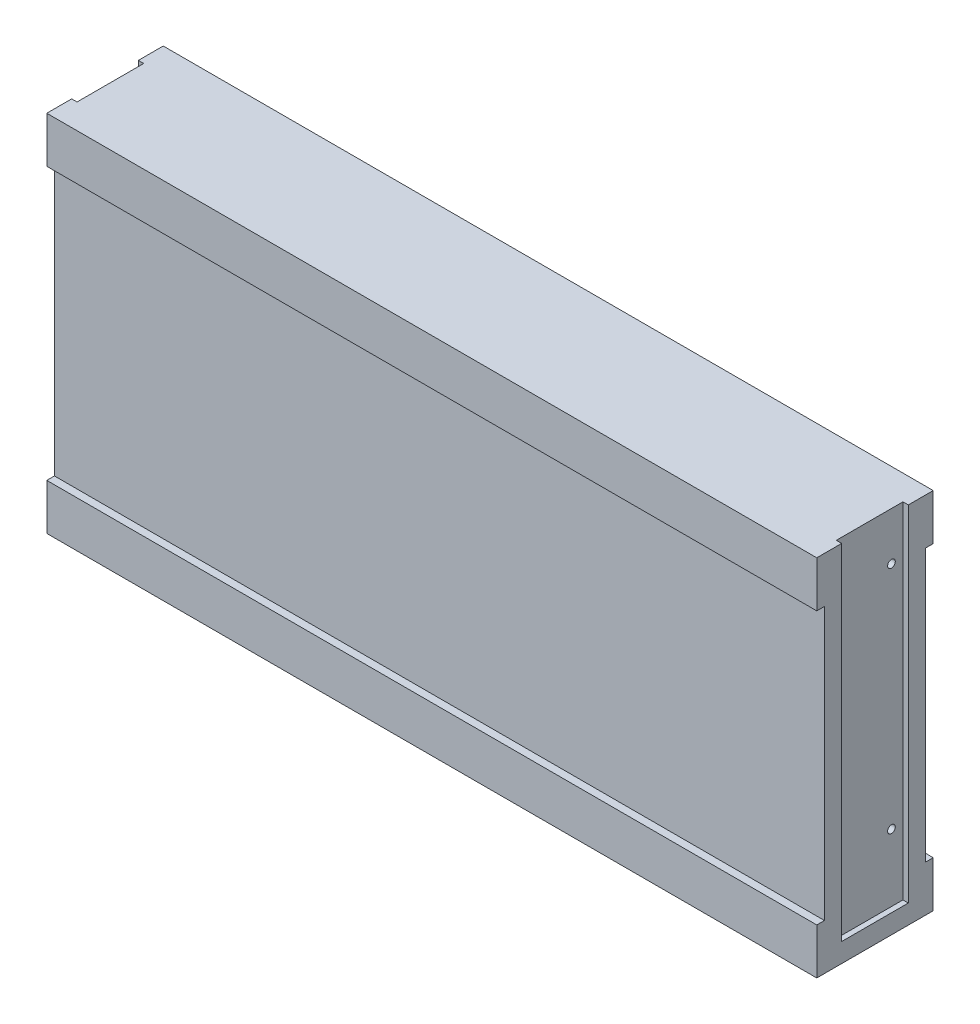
ISO-10303-21;
HEADER;
FILE_DESCRIPTION(('STEP AP214'),'2;1');
FILE_NAME('part.step','',(''),(''),'','','');
FILE_SCHEMA(('AUTOMOTIVE_DESIGN { 1 0 10303 214 1 1 1 1 }'));
ENDSEC;
DATA;
#1=APPLICATION_CONTEXT('core data for automotive mechanical design processes');
#2=APPLICATION_PROTOCOL_DEFINITION('international standard','automotive_design',2000,#1);
#3=PRODUCT_CONTEXT('',#1,'mechanical');
#4=PRODUCT('Part','Part','',(#3));
#5=PRODUCT_RELATED_PRODUCT_CATEGORY('part','',(#4));
#6=PRODUCT_DEFINITION_FORMATION('','',#4);
#7=PRODUCT_DEFINITION_CONTEXT('part definition',#1,'design');
#8=PRODUCT_DEFINITION('design','',#6,#7);
#9=PRODUCT_DEFINITION_SHAPE('','',#8);
#10=(LENGTH_UNIT() NAMED_UNIT(*) SI_UNIT(.MILLI.,.METRE.));
#11=(NAMED_UNIT(*) PLANE_ANGLE_UNIT() SI_UNIT($,.RADIAN.));
#12=(NAMED_UNIT(*) SI_UNIT($,.STERADIAN.) SOLID_ANGLE_UNIT());
#13=UNCERTAINTY_MEASURE_WITH_UNIT(LENGTH_MEASURE(1.E-05),#10,'distance_accuracy_value','');
#14=(GEOMETRIC_REPRESENTATION_CONTEXT(3) GLOBAL_UNCERTAINTY_ASSIGNED_CONTEXT((#13)) GLOBAL_UNIT_ASSIGNED_CONTEXT((#10,
#11,#12)) REPRESENTATION_CONTEXT('',''));
#15=CARTESIAN_POINT('',(0.,0.,0.));
#16=DIRECTION('',(0.,0.,1.));
#17=DIRECTION('',(1.,0.,0.));
#18=AXIS2_PLACEMENT_3D('',#15,#16,#17);
#19=CARTESIAN_POINT('',(0.,0.,0.));
#20=DIRECTION('',(0.,0.,1.));
#21=DIRECTION('',(1.,0.,0.));
#22=AXIS2_PLACEMENT_3D('',#19,#20,#21);
#23=PLANE('',#22);
#24=DIRECTION('',(0.,-1.,0.));
#25=VECTOR('',#24,1.);
#26=CARTESIAN_POINT('',(-136.451219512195,43.1006097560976,0.));
#27=LINE('',#26,#25);
#28=CARTESIAN_POINT('',(-136.451219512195,-39.8993902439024,0.));
#29=VERTEX_POINT('',#28);
#30=CARTESIAN_POINT('',(-136.451219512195,-51.8993902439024,0.));
#31=VERTEX_POINT('',#30);
#32=EDGE_CURVE('E290',#29,#31,#27,.T.);
#33=ORIENTED_EDGE('',*,*,#32,.F.);
#34=DIRECTION('',(1.,0.,0.));
#35=VECTOR('',#34,1.);
#36=CARTESIAN_POINT('',(-207.479382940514,-39.8993902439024,0.));
#37=LINE('',#36,#35);
#38=CARTESIAN_POINT('',(64.5487804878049,-39.8993902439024,0.));
#39=VERTEX_POINT('',#38);
#40=EDGE_CURVE('E248',#29,#39,#37,.T.);
#41=ORIENTED_EDGE('',*,*,#40,.T.);
#42=DIRECTION('',(0.,1.,0.));
#43=VECTOR('',#42,1.);
#44=CARTESIAN_POINT('',(64.5487804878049,43.1006097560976,0.));
#45=LINE('',#44,#43);
#46=CARTESIAN_POINT('',(64.5487804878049,-51.8993902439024,0.));
#47=VERTEX_POINT('',#46);
#48=EDGE_CURVE('E310',#47,#39,#45,.T.);
#49=ORIENTED_EDGE('',*,*,#48,.F.);
#50=DIRECTION('',(1.,0.,0.));
#51=VECTOR('',#50,1.);
#52=CARTESIAN_POINT('',(-136.451219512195,-51.8993902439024,0.));
#53=LINE('',#52,#51);
#54=EDGE_CURVE('E307',#31,#47,#53,.T.);
#55=ORIENTED_EDGE('',*,*,#54,.F.);
#56=EDGE_LOOP('',(#33,#41,#49,#55));
#57=FACE_BOUND('',#56,.T.);
#58=ADVANCED_FACE('F35',(#57),#23,.F.);
#59=CARTESIAN_POINT('',(0.,0.,30.4));
#60=DIRECTION('',(0.,0.,1.));
#61=DIRECTION('',(1.,0.,0.));
#62=AXIS2_PLACEMENT_3D('',#59,#60,#61);
#63=PLANE('',#62);
#64=DIRECTION('',(1.,0.,0.));
#65=VECTOR('',#64,1.);
#66=CARTESIAN_POINT('',(-207.479382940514,31.1006097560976,30.4));
#67=LINE('',#66,#65);
#68=CARTESIAN_POINT('',(-136.451219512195,31.1006097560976,30.4));
#69=VERTEX_POINT('',#68);
#70=CARTESIAN_POINT('',(64.5487804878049,31.1006097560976,30.4));
#71=VERTEX_POINT('',#70);
#72=EDGE_CURVE('E271',#69,#71,#67,.T.);
#73=ORIENTED_EDGE('',*,*,#72,.T.);
#74=DIRECTION('',(0.,1.,0.));
#75=VECTOR('',#74,1.);
#76=CARTESIAN_POINT('',(64.5487804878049,43.1006097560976,30.4));
#77=LINE('',#76,#75);
#78=CARTESIAN_POINT('',(64.5487804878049,43.1006097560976,30.4));
#79=VERTEX_POINT('',#78);
#80=EDGE_CURVE('E297',#71,#79,#77,.T.);
#81=ORIENTED_EDGE('',*,*,#80,.T.);
#82=DIRECTION('',(-1.,0.,0.));
#83=VECTOR('',#82,1.);
#84=CARTESIAN_POINT('',(-136.451219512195,43.1006097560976,30.4));
#85=LINE('',#84,#83);
#86=CARTESIAN_POINT('',(-136.451219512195,43.1006097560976,30.4));
#87=VERTEX_POINT('',#86);
#88=EDGE_CURVE('E301',#79,#87,#85,.T.);
#89=ORIENTED_EDGE('',*,*,#88,.T.);
#90=DIRECTION('',(0.,-1.,0.));
#91=VECTOR('',#90,1.);
#92=CARTESIAN_POINT('',(-136.451219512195,43.1006097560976,30.4));
#93=LINE('',#92,#91);
#94=EDGE_CURVE('E291',#87,#69,#93,.T.);
#95=ORIENTED_EDGE('',*,*,#94,.T.);
#96=EDGE_LOOP('',(#73,#81,#89,#95));
#97=FACE_BOUND('',#96,.T.);
#98=ADVANCED_FACE('F355',(#97),#63,.T.);
#99=CARTESIAN_POINT('',(-136.451219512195,43.1006097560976,30.4));
#100=DIRECTION('',(1.,0.,0.));
#101=DIRECTION('',(0.,0.,-1.));
#102=AXIS2_PLACEMENT_3D('',#99,#100,#101);
#103=PLANE('',#102);
#104=DIRECTION('',(0.,0.,-1.));
#105=VECTOR('',#104,1.);
#106=CARTESIAN_POINT('',(-136.451219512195,43.1006097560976,30.4));
#107=LINE('',#106,#105);
#108=CARTESIAN_POINT('',(-136.451219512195,43.1006097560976,23.9));
#109=VERTEX_POINT('',#108);
#110=EDGE_CURVE('E316',#87,#109,#107,.T.);
#111=ORIENTED_EDGE('',*,*,#110,.T.);
#112=DIRECTION('',(0.,1.,0.));
#113=VECTOR('',#112,1.);
#114=CARTESIAN_POINT('',(-136.451219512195,43.1006097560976,23.9));
#115=LINE('',#114,#113);
#116=CARTESIAN_POINT('',(-136.451219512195,-46.8993902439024,23.9));
#117=VERTEX_POINT('',#116);
#118=EDGE_CURVE('E215',#117,#109,#115,.T.);
#119=ORIENTED_EDGE('',*,*,#118,.F.);
#120=DIRECTION('',(0.,0.,1.));
#121=VECTOR('',#120,1.);
#122=CARTESIAN_POINT('',(-136.451219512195,-46.8993902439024,23.9));
#123=LINE('',#122,#121);
#124=CARTESIAN_POINT('',(-136.451219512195,-46.8993902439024,6.50000000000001));
#125=VERTEX_POINT('',#124);
#126=EDGE_CURVE('E218',#125,#117,#123,.T.);
#127=ORIENTED_EDGE('',*,*,#126,.F.);
#128=DIRECTION('',(0.,-1.,0.));
#129=VECTOR('',#128,1.);
#130=CARTESIAN_POINT('',(-136.451219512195,43.1006097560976,6.5));
#131=LINE('',#130,#129);
#132=CARTESIAN_POINT('',(-136.451219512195,43.1006097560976,6.5));
#133=VERTEX_POINT('',#132);
#134=EDGE_CURVE('E227',#133,#125,#131,.T.);
#135=ORIENTED_EDGE('',*,*,#134,.F.);
#136=CARTESIAN_POINT('',(-136.451219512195,43.1006097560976,0.));
#137=VERTEX_POINT('',#136);
#138=EDGE_CURVE('E303',#133,#137,#107,.T.);
#139=ORIENTED_EDGE('',*,*,#138,.T.);
#140=CARTESIAN_POINT('',(-136.451219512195,31.1006097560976,0.));
#141=VERTEX_POINT('',#140);
#142=EDGE_CURVE('E304',#137,#141,#27,.T.);
#143=ORIENTED_EDGE('',*,*,#142,.T.);
#144=DIRECTION('',(0.,0.,-1.));
#145=VECTOR('',#144,1.);
#146=CARTESIAN_POINT('',(-136.451219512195,31.1006097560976,0.));
#147=LINE('',#146,#145);
#148=CARTESIAN_POINT('',(-136.451219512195,31.1006097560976,2.));
#149=VERTEX_POINT('',#148);
#150=EDGE_CURVE('E250',#149,#141,#147,.T.);
#151=ORIENTED_EDGE('',*,*,#150,.F.);
#152=DIRECTION('',(0.,1.,0.));
#153=VECTOR('',#152,1.);
#154=CARTESIAN_POINT('',(-136.451219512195,-39.8993902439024,2.));
#155=LINE('',#154,#153);
#156=CARTESIAN_POINT('',(-136.451219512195,-39.8993902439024,2.));
#157=VERTEX_POINT('',#156);
#158=EDGE_CURVE('E245',#157,#149,#155,.T.);
#159=ORIENTED_EDGE('',*,*,#158,.F.);
#160=DIRECTION('',(0.,0.,1.));
#161=VECTOR('',#160,1.);
#162=CARTESIAN_POINT('',(-136.451219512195,-39.8993902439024,0.));
#163=LINE('',#162,#161);
#164=EDGE_CURVE('E247',#29,#157,#163,.T.);
#165=ORIENTED_EDGE('',*,*,#164,.F.);
#166=ORIENTED_EDGE('',*,*,#32,.T.);
#167=DIRECTION('',(0.,0.,-1.));
#168=VECTOR('',#167,1.);
#169=CARTESIAN_POINT('',(-136.451219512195,-51.8993902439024,30.4));
#170=LINE('',#169,#168);
#171=CARTESIAN_POINT('',(-136.451219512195,-51.8993902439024,30.4));
#172=VERTEX_POINT('',#171);
#173=EDGE_CURVE('E11',#172,#31,#170,.T.);
#174=ORIENTED_EDGE('',*,*,#173,.F.);
#175=CARTESIAN_POINT('',(-136.451219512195,-39.8993902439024,30.4));
#176=VERTEX_POINT('',#175);
#177=EDGE_CURVE('E295',#176,#172,#93,.T.);
#178=ORIENTED_EDGE('',*,*,#177,.F.);
#179=DIRECTION('',(0.,0.,1.));
#180=VECTOR('',#179,1.);
#181=CARTESIAN_POINT('',(-136.451219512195,-39.8993902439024,30.4));
#182=LINE('',#181,#180);
#183=CARTESIAN_POINT('',(-136.451219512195,-39.8993902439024,28.4));
#184=VERTEX_POINT('',#183);
#185=EDGE_CURVE('E273',#184,#176,#182,.T.);
#186=ORIENTED_EDGE('',*,*,#185,.F.);
#187=DIRECTION('',(0.,-1.,0.));
#188=VECTOR('',#187,1.);
#189=CARTESIAN_POINT('',(-136.451219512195,-39.8993902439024,28.4));
#190=LINE('',#189,#188);
#191=CARTESIAN_POINT('',(-136.451219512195,31.1006097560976,28.4));
#192=VERTEX_POINT('',#191);
#193=EDGE_CURVE('E268',#192,#184,#190,.T.);
#194=ORIENTED_EDGE('',*,*,#193,.F.);
#195=DIRECTION('',(0.,0.,-1.));
#196=VECTOR('',#195,1.);
#197=CARTESIAN_POINT('',(-136.451219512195,31.1006097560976,30.4));
#198=LINE('',#197,#196);
#199=EDGE_CURVE('E270',#69,#192,#198,.T.);
#200=ORIENTED_EDGE('',*,*,#199,.F.);
#201=ORIENTED_EDGE('',*,*,#94,.F.);
#202=EDGE_LOOP('',(#111,#119,#127,#135,#139,#143,#151,#159,#165,#166,#174,#178,#186,#194,#200,#201));
#203=FACE_BOUND('',#202,.T.);
#204=ADVANCED_FACE('F37',(#203),#103,.F.);
#205=CARTESIAN_POINT('',(-136.451219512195,-51.8993902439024,30.4));
#206=DIRECTION('',(0.,1.,0.));
#207=DIRECTION('',(0.,0.,1.));
#208=AXIS2_PLACEMENT_3D('',#205,#206,#207);
#209=PLANE('',#208);
#210=ORIENTED_EDGE('',*,*,#54,.T.);
#211=DIRECTION('',(0.,0.,-1.));
#212=VECTOR('',#211,1.);
#213=CARTESIAN_POINT('',(64.5487804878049,-51.8993902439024,30.4));
#214=LINE('',#213,#212);
#215=CARTESIAN_POINT('',(64.5487804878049,-51.8993902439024,30.4));
#216=VERTEX_POINT('',#215);
#217=EDGE_CURVE('E44',#216,#47,#214,.T.);
#218=ORIENTED_EDGE('',*,*,#217,.F.);
#219=DIRECTION('',(1.,0.,0.));
#220=VECTOR('',#219,1.);
#221=CARTESIAN_POINT('',(-136.451219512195,-51.8993902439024,30.4));
#222=LINE('',#221,#220);
#223=EDGE_CURVE('E294',#172,#216,#222,.T.);
#224=ORIENTED_EDGE('',*,*,#223,.F.);
#225=ORIENTED_EDGE('',*,*,#173,.T.);
#226=EDGE_LOOP('',(#210,#218,#224,#225));
#227=FACE_BOUND('',#226,.T.);
#228=ADVANCED_FACE('F371',(#227),#209,.F.);
#229=CARTESIAN_POINT('',(64.5487804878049,43.1006097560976,30.4));
#230=DIRECTION('',(-1.,0.,0.));
#231=DIRECTION('',(0.,0.,1.));
#232=AXIS2_PLACEMENT_3D('',#229,#230,#231);
#233=PLANE('',#232);
#234=DIRECTION('',(0.,0.,-1.));
#235=VECTOR('',#234,1.);
#236=CARTESIAN_POINT('',(64.5487804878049,-46.8993902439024,23.9));
#237=LINE('',#236,#235);
#238=CARTESIAN_POINT('',(64.5487804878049,-46.8993902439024,23.9));
#239=VERTEX_POINT('',#238);
#240=CARTESIAN_POINT('',(64.5487804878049,-46.8993902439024,6.50000000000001));
#241=VERTEX_POINT('',#240);
#242=EDGE_CURVE('E199',#239,#241,#237,.T.);
#243=ORIENTED_EDGE('',*,*,#242,.F.);
#244=DIRECTION('',(0.,-1.,0.));
#245=VECTOR('',#244,1.);
#246=CARTESIAN_POINT('',(64.5487804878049,-46.8993902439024,23.9));
#247=LINE('',#246,#245);
#248=CARTESIAN_POINT('',(64.5487804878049,43.1006097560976,23.9));
#249=VERTEX_POINT('',#248);
#250=EDGE_CURVE('E183',#249,#239,#247,.T.);
#251=ORIENTED_EDGE('',*,*,#250,.F.);
#252=DIRECTION('',(0.,0.,-1.));
#253=VECTOR('',#252,1.);
#254=CARTESIAN_POINT('',(64.5487804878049,43.1006097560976,30.4));
#255=LINE('',#254,#253);
#256=EDGE_CURVE('E320',#79,#249,#255,.T.);
#257=ORIENTED_EDGE('',*,*,#256,.F.);
#258=ORIENTED_EDGE('',*,*,#80,.F.);
#259=DIRECTION('',(0.,0.,1.));
#260=VECTOR('',#259,1.);
#261=CARTESIAN_POINT('',(64.5487804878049,31.1006097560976,30.4));
#262=LINE('',#261,#260);
#263=CARTESIAN_POINT('',(64.5487804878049,31.1006097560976,28.4));
#264=VERTEX_POINT('',#263);
#265=EDGE_CURVE('E279',#264,#71,#262,.T.);
#266=ORIENTED_EDGE('',*,*,#265,.F.);
#267=DIRECTION('',(0.,1.,0.));
#268=VECTOR('',#267,1.);
#269=CARTESIAN_POINT('',(64.5487804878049,-39.8993902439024,28.4));
#270=LINE('',#269,#268);
#271=CARTESIAN_POINT('',(64.5487804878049,-39.8993902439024,28.4));
#272=VERTEX_POINT('',#271);
#273=EDGE_CURVE('E276',#272,#264,#270,.T.);
#274=ORIENTED_EDGE('',*,*,#273,.F.);
#275=DIRECTION('',(0.,0.,-1.));
#276=VECTOR('',#275,1.);
#277=CARTESIAN_POINT('',(64.5487804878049,-39.8993902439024,30.4));
#278=LINE('',#277,#276);
#279=CARTESIAN_POINT('',(64.5487804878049,-39.8993902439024,30.4));
#280=VERTEX_POINT('',#279);
#281=EDGE_CURVE('E267',#280,#272,#278,.T.);
#282=ORIENTED_EDGE('',*,*,#281,.F.);
#283=EDGE_CURVE('E298',#216,#280,#77,.T.);
#284=ORIENTED_EDGE('',*,*,#283,.F.);
#285=ORIENTED_EDGE('',*,*,#217,.T.);
#286=ORIENTED_EDGE('',*,*,#48,.T.);
#287=DIRECTION('',(0.,0.,-1.));
#288=VECTOR('',#287,1.);
#289=CARTESIAN_POINT('',(64.5487804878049,-39.8993902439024,0.));
#290=LINE('',#289,#288);
#291=CARTESIAN_POINT('',(64.5487804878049,-39.8993902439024,2.));
#292=VERTEX_POINT('',#291);
#293=EDGE_CURVE('E256',#292,#39,#290,.T.);
#294=ORIENTED_EDGE('',*,*,#293,.F.);
#295=DIRECTION('',(0.,-1.,0.));
#296=VECTOR('',#295,1.);
#297=CARTESIAN_POINT('',(64.5487804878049,-39.8993902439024,2.));
#298=LINE('',#297,#296);
#299=CARTESIAN_POINT('',(64.5487804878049,31.1006097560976,2.));
#300=VERTEX_POINT('',#299);
#301=EDGE_CURVE('E253',#300,#292,#298,.T.);
#302=ORIENTED_EDGE('',*,*,#301,.F.);
#303=DIRECTION('',(0.,0.,1.));
#304=VECTOR('',#303,1.);
#305=CARTESIAN_POINT('',(64.5487804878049,31.1006097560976,0.));
#306=LINE('',#305,#304);
#307=CARTESIAN_POINT('',(64.5487804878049,31.1006097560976,0.));
#308=VERTEX_POINT('',#307);
#309=EDGE_CURVE('E244',#308,#300,#306,.T.);
#310=ORIENTED_EDGE('',*,*,#309,.F.);
#311=CARTESIAN_POINT('',(64.5487804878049,43.1006097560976,0.));
#312=VERTEX_POINT('',#311);
#313=EDGE_CURVE('E309',#308,#312,#45,.T.);
#314=ORIENTED_EDGE('',*,*,#313,.T.);
#315=CARTESIAN_POINT('',(64.5487804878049,43.1006097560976,6.50000000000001));
#316=VERTEX_POINT('',#315);
#317=EDGE_CURVE('E319',#316,#312,#255,.T.);
#318=ORIENTED_EDGE('',*,*,#317,.F.);
#319=DIRECTION('',(0.,1.,0.));
#320=VECTOR('',#319,1.);
#321=CARTESIAN_POINT('',(64.5487804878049,-46.8993902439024,6.50000000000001));
#322=LINE('',#321,#320);
#323=EDGE_CURVE('E197',#241,#316,#322,.T.);
#324=ORIENTED_EDGE('',*,*,#323,.F.);
#325=EDGE_LOOP('',(#243,#251,#257,#258,#266,#274,#282,#284,#285,#286,#294,#302,#310,#314,#318,#324));
#326=FACE_BOUND('',#325,.T.);
#327=ADVANCED_FACE('F368',(#326),#233,.F.);
#328=CARTESIAN_POINT('',(-136.451219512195,43.1006097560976,30.4));
#329=DIRECTION('',(0.,-1.,0.));
#330=DIRECTION('',(0.,0.,-1.));
#331=AXIS2_PLACEMENT_3D('',#328,#329,#330);
#332=PLANE('',#331);
#333=ORIENTED_EDGE('',*,*,#256,.T.);
#334=DIRECTION('',(1.,0.,0.));
#335=VECTOR('',#334,1.);
#336=CARTESIAN_POINT('',(63.1487804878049,43.1006097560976,23.9));
#337=LINE('',#336,#335);
#338=CARTESIAN_POINT('',(63.1487804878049,43.1006097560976,23.9));
#339=VERTEX_POINT('',#338);
#340=EDGE_CURVE('E206',#339,#249,#337,.T.);
#341=ORIENTED_EDGE('',*,*,#340,.F.);
#342=DIRECTION('',(0.,0.,1.));
#343=VECTOR('',#342,1.);
#344=CARTESIAN_POINT('',(63.1487804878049,43.1006097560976,23.9));
#345=LINE('',#344,#343);
#346=CARTESIAN_POINT('',(63.1487804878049,43.1006097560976,6.50000000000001));
#347=VERTEX_POINT('',#346);
#348=EDGE_CURVE('E188',#347,#339,#345,.T.);
#349=ORIENTED_EDGE('',*,*,#348,.F.);
#350=DIRECTION('',(1.,0.,0.));
#351=VECTOR('',#350,1.);
#352=CARTESIAN_POINT('',(63.1487804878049,43.1006097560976,6.50000000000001));
#353=LINE('',#352,#351);
#354=EDGE_CURVE('E208',#347,#316,#353,.T.);
#355=ORIENTED_EDGE('',*,*,#354,.T.);
#356=ORIENTED_EDGE('',*,*,#317,.T.);
#357=DIRECTION('',(-1.,0.,0.));
#358=VECTOR('',#357,1.);
#359=CARTESIAN_POINT('',(-136.451219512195,43.1006097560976,0.));
#360=LINE('',#359,#358);
#361=EDGE_CURVE('E313',#312,#137,#360,.T.);
#362=ORIENTED_EDGE('',*,*,#361,.T.);
#363=ORIENTED_EDGE('',*,*,#138,.F.);
#364=DIRECTION('',(-1.,0.,0.));
#365=VECTOR('',#364,1.);
#366=CARTESIAN_POINT('',(-135.051219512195,43.1006097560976,6.5));
#367=LINE('',#366,#365);
#368=CARTESIAN_POINT('',(-135.051219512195,43.1006097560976,6.5));
#369=VERTEX_POINT('',#368);
#370=EDGE_CURVE('E237',#369,#133,#367,.T.);
#371=ORIENTED_EDGE('',*,*,#370,.F.);
#372=DIRECTION('',(0.,0.,-1.));
#373=VECTOR('',#372,1.);
#374=CARTESIAN_POINT('',(-135.051219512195,43.1006097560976,23.9));
#375=LINE('',#374,#373);
#376=CARTESIAN_POINT('',(-135.051219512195,43.1006097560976,23.9));
#377=VERTEX_POINT('',#376);
#378=EDGE_CURVE('E217',#377,#369,#375,.T.);
#379=ORIENTED_EDGE('',*,*,#378,.F.);
#380=DIRECTION('',(-1.,0.,0.));
#381=VECTOR('',#380,1.);
#382=CARTESIAN_POINT('',(-135.051219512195,43.1006097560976,23.9));
#383=LINE('',#382,#381);
#384=EDGE_CURVE('E225',#377,#109,#383,.T.);
#385=ORIENTED_EDGE('',*,*,#384,.T.);
#386=ORIENTED_EDGE('',*,*,#110,.F.);
#387=ORIENTED_EDGE('',*,*,#88,.F.);
#388=EDGE_LOOP('',(#333,#341,#349,#355,#356,#362,#363,#371,#379,#385,#386,#387));
#389=FACE_BOUND('',#388,.T.);
#390=ADVANCED_FACE('F365',(#389),#332,.F.);
#391=DIRECTION('',(1.,0.,0.));
#392=VECTOR('',#391,1.);
#393=CARTESIAN_POINT('',(-207.479382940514,-39.8993902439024,30.4));
#394=LINE('',#393,#392);
#395=EDGE_CURVE('E281',#176,#280,#394,.T.);
#396=ORIENTED_EDGE('',*,*,#395,.F.);
#397=ORIENTED_EDGE('',*,*,#177,.T.);
#398=ORIENTED_EDGE('',*,*,#223,.T.);
#399=ORIENTED_EDGE('',*,*,#283,.T.);
#400=EDGE_LOOP('',(#396,#397,#398,#399));
#401=FACE_BOUND('',#400,.T.);
#402=ADVANCED_FACE('F350',(#401),#63,.T.);
#403=ORIENTED_EDGE('',*,*,#313,.F.);
#404=DIRECTION('',(1.,0.,0.));
#405=VECTOR('',#404,1.);
#406=CARTESIAN_POINT('',(-207.479382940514,31.1006097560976,0.));
#407=LINE('',#406,#405);
#408=EDGE_CURVE('E258',#141,#308,#407,.T.);
#409=ORIENTED_EDGE('',*,*,#408,.F.);
#410=ORIENTED_EDGE('',*,*,#142,.F.);
#411=ORIENTED_EDGE('',*,*,#361,.F.);
#412=EDGE_LOOP('',(#403,#409,#410,#411));
#413=FACE_BOUND('',#412,.T.);
#414=ADVANCED_FACE('F339',(#413),#23,.F.);
#415=CARTESIAN_POINT('',(-139.279646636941,-29.3993902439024,9.5));
#416=DIRECTION('',(1.,0.,0.));
#417=DIRECTION('',(0.,0.,-1.));
#418=AXIS2_PLACEMENT_3D('',#415,#416,#417);
#419=CYLINDRICAL_SURFACE('',#418,1.);
#420=CARTESIAN_POINT('',(63.1487804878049,-29.3993902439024,9.5));
#421=DIRECTION('',(-1.,0.,0.));
#422=DIRECTION('',(0.,0.,1.));
#423=AXIS2_PLACEMENT_3D('',#420,#421,#422);
#424=CIRCLE('',#423,1.);
#425=CARTESIAN_POINT('',(63.1487804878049,-29.3993902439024,10.5));
#426=VERTEX_POINT('',#425);
#427=EDGE_CURVE('E212',#426,#426,#424,.F.);
#428=ORIENTED_EDGE('',*,*,#427,.T.);
#429=EDGE_LOOP('',(#428));
#430=FACE_BOUND('',#429,.T.);
#431=CARTESIAN_POINT('',(-135.051219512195,-29.3993902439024,9.5));
#432=DIRECTION('',(1.,0.,0.));
#433=DIRECTION('',(0.,0.,-1.));
#434=AXIS2_PLACEMENT_3D('',#431,#432,#433);
#435=CIRCLE('',#434,1.);
#436=CARTESIAN_POINT('',(-135.051219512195,-29.3993902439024,8.5));
#437=VERTEX_POINT('',#436);
#438=EDGE_CURVE('E241',#437,#437,#435,.F.);
#439=ORIENTED_EDGE('',*,*,#438,.T.);
#440=EDGE_LOOP('',(#439));
#441=FACE_BOUND('',#440,.T.);
#442=ADVANCED_FACE('F337',(#430,#441),#419,.F.);
#443=CARTESIAN_POINT('',(-139.279646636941,30.6006097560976,9.5));
#444=DIRECTION('',(1.,0.,0.));
#445=DIRECTION('',(0.,0.,-1.));
#446=AXIS2_PLACEMENT_3D('',#443,#444,#445);
#447=CYLINDRICAL_SURFACE('',#446,1.);
#448=CARTESIAN_POINT('',(63.1487804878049,30.6006097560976,9.5));
#449=DIRECTION('',(-1.,0.,0.));
#450=DIRECTION('',(0.,0.,1.));
#451=AXIS2_PLACEMENT_3D('',#448,#449,#450);
#452=CIRCLE('',#451,1.);
#453=CARTESIAN_POINT('',(63.1487804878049,30.6006097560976,10.5));
#454=VERTEX_POINT('',#453);
#455=EDGE_CURVE('E39',#454,#454,#452,.F.);
#456=ORIENTED_EDGE('',*,*,#455,.T.);
#457=EDGE_LOOP('',(#456));
#458=FACE_BOUND('',#457,.T.);
#459=CARTESIAN_POINT('',(-135.051219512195,30.6006097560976,9.5));
#460=DIRECTION('',(1.,0.,0.));
#461=DIRECTION('',(0.,0.,-1.));
#462=AXIS2_PLACEMENT_3D('',#459,#460,#461);
#463=CIRCLE('',#462,1.);
#464=CARTESIAN_POINT('',(-135.051219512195,30.6006097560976,8.5));
#465=VERTEX_POINT('',#464);
#466=EDGE_CURVE('E234',#465,#465,#463,.F.);
#467=ORIENTED_EDGE('',*,*,#466,.T.);
#468=EDGE_LOOP('',(#467));
#469=FACE_BOUND('',#468,.T.);
#470=ADVANCED_FACE('F327',(#458,#469),#447,.F.);
#471=CARTESIAN_POINT('',(-207.479382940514,31.1006097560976,30.4));
#472=DIRECTION('',(0.,1.,0.));
#473=DIRECTION('',(0.,0.,1.));
#474=AXIS2_PLACEMENT_3D('',#471,#472,#473);
#475=PLANE('',#474);
#476=ORIENTED_EDGE('',*,*,#199,.T.);
#477=DIRECTION('',(1.,0.,0.));
#478=VECTOR('',#477,1.);
#479=CARTESIAN_POINT('',(-207.479382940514,31.1006097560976,28.4));
#480=LINE('',#479,#478);
#481=EDGE_CURVE('E284',#192,#264,#480,.T.);
#482=ORIENTED_EDGE('',*,*,#481,.T.);
#483=ORIENTED_EDGE('',*,*,#265,.T.);
#484=ORIENTED_EDGE('',*,*,#72,.F.);
#485=EDGE_LOOP('',(#476,#482,#483,#484));
#486=FACE_BOUND('',#485,.T.);
#487=ADVANCED_FACE('F346',(#486),#475,.F.);
#488=CARTESIAN_POINT('',(-207.479382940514,-39.8993902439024,28.4));
#489=DIRECTION('',(0.,0.,-1.));
#490=DIRECTION('',(0.,1.,0.));
#491=AXIS2_PLACEMENT_3D('',#488,#489,#490);
#492=PLANE('',#491);
#493=ORIENTED_EDGE('',*,*,#193,.T.);
#494=DIRECTION('',(1.,0.,0.));
#495=VECTOR('',#494,1.);
#496=CARTESIAN_POINT('',(-207.479382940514,-39.8993902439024,28.4));
#497=LINE('',#496,#495);
#498=EDGE_CURVE('E286',#184,#272,#497,.T.);
#499=ORIENTED_EDGE('',*,*,#498,.T.);
#500=ORIENTED_EDGE('',*,*,#273,.T.);
#501=ORIENTED_EDGE('',*,*,#481,.F.);
#502=EDGE_LOOP('',(#493,#499,#500,#501));
#503=FACE_BOUND('',#502,.T.);
#504=ADVANCED_FACE('F426',(#503),#492,.F.);
#505=CARTESIAN_POINT('',(-207.479382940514,-39.8993902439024,30.4));
#506=DIRECTION('',(0.,-1.,0.));
#507=DIRECTION('',(0.,0.,-1.));
#508=AXIS2_PLACEMENT_3D('',#505,#506,#507);
#509=PLANE('',#508);
#510=ORIENTED_EDGE('',*,*,#185,.T.);
#511=ORIENTED_EDGE('',*,*,#395,.T.);
#512=ORIENTED_EDGE('',*,*,#281,.T.);
#513=ORIENTED_EDGE('',*,*,#498,.F.);
#514=EDGE_LOOP('',(#510,#511,#512,#513));
#515=FACE_BOUND('',#514,.T.);
#516=ADVANCED_FACE('F428',(#515),#509,.F.);
#517=CARTESIAN_POINT('',(-207.479382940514,-39.8993902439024,0.));
#518=DIRECTION('',(0.,-1.,0.));
#519=DIRECTION('',(0.,0.,-1.));
#520=AXIS2_PLACEMENT_3D('',#517,#518,#519);
#521=PLANE('',#520);
#522=ORIENTED_EDGE('',*,*,#164,.T.);
#523=DIRECTION('',(1.,0.,0.));
#524=VECTOR('',#523,1.);
#525=CARTESIAN_POINT('',(-207.479382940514,-39.8993902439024,2.));
#526=LINE('',#525,#524);
#527=EDGE_CURVE('E261',#157,#292,#526,.T.);
#528=ORIENTED_EDGE('',*,*,#527,.T.);
#529=ORIENTED_EDGE('',*,*,#293,.T.);
#530=ORIENTED_EDGE('',*,*,#40,.F.);
#531=EDGE_LOOP('',(#522,#528,#529,#530));
#532=FACE_BOUND('',#531,.T.);
#533=ADVANCED_FACE('F391',(#532),#521,.F.);
#534=CARTESIAN_POINT('',(-207.479382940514,-39.8993902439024,2.));
#535=DIRECTION('',(0.,0.,1.));
#536=DIRECTION('',(1.,0.,0.));
#537=AXIS2_PLACEMENT_3D('',#534,#535,#536);
#538=PLANE('',#537);
#539=ORIENTED_EDGE('',*,*,#158,.T.);
#540=DIRECTION('',(1.,0.,0.));
#541=VECTOR('',#540,1.);
#542=CARTESIAN_POINT('',(-207.479382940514,31.1006097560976,2.));
#543=LINE('',#542,#541);
#544=EDGE_CURVE('E263',#149,#300,#543,.T.);
#545=ORIENTED_EDGE('',*,*,#544,.T.);
#546=ORIENTED_EDGE('',*,*,#301,.T.);
#547=ORIENTED_EDGE('',*,*,#527,.F.);
#548=EDGE_LOOP('',(#539,#545,#546,#547));
#549=FACE_BOUND('',#548,.T.);
#550=ADVANCED_FACE('F397',(#549),#538,.F.);
#551=CARTESIAN_POINT('',(-207.479382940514,31.1006097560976,0.));
#552=DIRECTION('',(0.,1.,0.));
#553=DIRECTION('',(0.,0.,1.));
#554=AXIS2_PLACEMENT_3D('',#551,#552,#553);
#555=PLANE('',#554);
#556=ORIENTED_EDGE('',*,*,#150,.T.);
#557=ORIENTED_EDGE('',*,*,#408,.T.);
#558=ORIENTED_EDGE('',*,*,#309,.T.);
#559=ORIENTED_EDGE('',*,*,#544,.F.);
#560=EDGE_LOOP('',(#556,#557,#558,#559));
#561=FACE_BOUND('',#560,.T.);
#562=ADVANCED_FACE('F332',(#561),#555,.F.);
#563=CARTESIAN_POINT('',(-135.051219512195,0.,0.));
#564=DIRECTION('',(1.,0.,0.));
#565=DIRECTION('',(0.,0.,-1.));
#566=AXIS2_PLACEMENT_3D('',#563,#564,#565);
#567=PLANE('',#566);
#568=ORIENTED_EDGE('',*,*,#466,.F.);
#569=EDGE_LOOP('',(#568));
#570=FACE_BOUND('',#569,.T.);
#571=DIRECTION('',(0.,1.,0.));
#572=VECTOR('',#571,1.);
#573=CARTESIAN_POINT('',(-135.051219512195,43.1006097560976,23.9));
#574=LINE('',#573,#572);
#575=CARTESIAN_POINT('',(-135.051219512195,-46.8993902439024,23.9));
#576=VERTEX_POINT('',#575);
#577=EDGE_CURVE('E60',#576,#377,#574,.T.);
#578=ORIENTED_EDGE('',*,*,#577,.T.);
#579=ORIENTED_EDGE('',*,*,#378,.T.);
#580=DIRECTION('',(0.,-1.,0.));
#581=VECTOR('',#580,1.);
#582=CARTESIAN_POINT('',(-135.051219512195,43.1006097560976,6.5));
#583=LINE('',#582,#581);
#584=CARTESIAN_POINT('',(-135.051219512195,-46.8993902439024,6.50000000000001));
#585=VERTEX_POINT('',#584);
#586=EDGE_CURVE('E220',#369,#585,#583,.T.);
#587=ORIENTED_EDGE('',*,*,#586,.T.);
#588=DIRECTION('',(0.,0.,1.));
#589=VECTOR('',#588,1.);
#590=CARTESIAN_POINT('',(-135.051219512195,-46.8993902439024,23.9));
#591=LINE('',#590,#589);
#592=EDGE_CURVE('E223',#585,#576,#591,.T.);
#593=ORIENTED_EDGE('',*,*,#592,.T.);
#594=EDGE_LOOP('',(#578,#579,#587,#593));
#595=FACE_BOUND('',#594,.T.);
#596=ORIENTED_EDGE('',*,*,#438,.F.);
#597=EDGE_LOOP('',(#596));
#598=FACE_BOUND('',#597,.T.);
#599=ADVANCED_FACE('F329',(#570,#595,#598),#567,.F.);
#600=CARTESIAN_POINT('',(-135.051219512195,43.1006097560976,23.9));
#601=DIRECTION('',(0.,0.,1.));
#602=DIRECTION('',(0.,-1.,0.));
#603=AXIS2_PLACEMENT_3D('',#600,#601,#602);
#604=PLANE('',#603);
#605=ORIENTED_EDGE('',*,*,#118,.T.);
#606=ORIENTED_EDGE('',*,*,#384,.F.);
#607=ORIENTED_EDGE('',*,*,#577,.F.);
#608=DIRECTION('',(-1.,0.,0.));
#609=VECTOR('',#608,1.);
#610=CARTESIAN_POINT('',(-135.051219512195,-46.8993902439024,23.9));
#611=LINE('',#610,#609);
#612=EDGE_CURVE('E232',#576,#117,#611,.T.);
#613=ORIENTED_EDGE('',*,*,#612,.T.);
#614=EDGE_LOOP('',(#605,#606,#607,#613));
#615=FACE_BOUND('',#614,.T.);
#616=ADVANCED_FACE('F331',(#615),#604,.F.);
#617=CARTESIAN_POINT('',(-135.051219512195,-46.8993902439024,23.9));
#618=DIRECTION('',(0.,-1.,0.));
#619=DIRECTION('',(0.,0.,-1.));
#620=AXIS2_PLACEMENT_3D('',#617,#618,#619);
#621=PLANE('',#620);
#622=ORIENTED_EDGE('',*,*,#126,.T.);
#623=ORIENTED_EDGE('',*,*,#612,.F.);
#624=ORIENTED_EDGE('',*,*,#592,.F.);
#625=DIRECTION('',(-1.,0.,0.));
#626=VECTOR('',#625,1.);
#627=CARTESIAN_POINT('',(-135.051219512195,-46.8993902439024,6.50000000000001));
#628=LINE('',#627,#626);
#629=EDGE_CURVE('E235',#585,#125,#628,.T.);
#630=ORIENTED_EDGE('',*,*,#629,.T.);
#631=EDGE_LOOP('',(#622,#623,#624,#630));
#632=FACE_BOUND('',#631,.T.);
#633=ADVANCED_FACE('F536',(#632),#621,.F.);
#634=CARTESIAN_POINT('',(-135.051219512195,43.1006097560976,6.5));
#635=DIRECTION('',(0.,0.,-1.));
#636=DIRECTION('',(0.,1.,0.));
#637=AXIS2_PLACEMENT_3D('',#634,#635,#636);
#638=PLANE('',#637);
#639=ORIENTED_EDGE('',*,*,#134,.T.);
#640=ORIENTED_EDGE('',*,*,#629,.F.);
#641=ORIENTED_EDGE('',*,*,#586,.F.);
#642=ORIENTED_EDGE('',*,*,#370,.T.);
#643=EDGE_LOOP('',(#639,#640,#641,#642));
#644=FACE_BOUND('',#643,.T.);
#645=ADVANCED_FACE('F545',(#644),#638,.F.);
#646=CARTESIAN_POINT('',(63.1487804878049,0.,0.));
#647=DIRECTION('',(-1.,0.,0.));
#648=DIRECTION('',(0.,0.,1.));
#649=AXIS2_PLACEMENT_3D('',#646,#647,#648);
#650=PLANE('',#649);
#651=ORIENTED_EDGE('',*,*,#455,.F.);
#652=EDGE_LOOP('',(#651));
#653=FACE_BOUND('',#652,.T.);
#654=DIRECTION('',(0.,-1.,0.));
#655=VECTOR('',#654,1.);
#656=CARTESIAN_POINT('',(63.1487804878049,-46.8993902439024,23.9));
#657=LINE('',#656,#655);
#658=CARTESIAN_POINT('',(63.1487804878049,-46.8993902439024,23.9));
#659=VERTEX_POINT('',#658);
#660=EDGE_CURVE('E181',#339,#659,#657,.T.);
#661=ORIENTED_EDGE('',*,*,#660,.T.);
#662=DIRECTION('',(0.,0.,-1.));
#663=VECTOR('',#662,1.);
#664=CARTESIAN_POINT('',(63.1487804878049,-46.8993902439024,23.9));
#665=LINE('',#664,#663);
#666=CARTESIAN_POINT('',(63.1487804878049,-46.8993902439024,6.50000000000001));
#667=VERTEX_POINT('',#666);
#668=EDGE_CURVE('E190',#659,#667,#665,.T.);
#669=ORIENTED_EDGE('',*,*,#668,.T.);
#670=DIRECTION('',(0.,1.,0.));
#671=VECTOR('',#670,1.);
#672=CARTESIAN_POINT('',(63.1487804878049,-46.8993902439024,6.50000000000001));
#673=LINE('',#672,#671);
#674=EDGE_CURVE('E52',#667,#347,#673,.T.);
#675=ORIENTED_EDGE('',*,*,#674,.T.);
#676=ORIENTED_EDGE('',*,*,#348,.T.);
#677=EDGE_LOOP('',(#661,#669,#675,#676));
#678=FACE_BOUND('',#677,.T.);
#679=ORIENTED_EDGE('',*,*,#427,.F.);
#680=EDGE_LOOP('',(#679));
#681=FACE_BOUND('',#680,.T.);
#682=ADVANCED_FACE('F193',(#653,#678,#681),#650,.F.);
#683=CARTESIAN_POINT('',(63.1487804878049,-46.8993902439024,23.9));
#684=DIRECTION('',(0.,0.,1.));
#685=DIRECTION('',(1.,0.,0.));
#686=AXIS2_PLACEMENT_3D('',#683,#684,#685);
#687=PLANE('',#686);
#688=ORIENTED_EDGE('',*,*,#250,.T.);
#689=DIRECTION('',(1.,0.,0.));
#690=VECTOR('',#689,1.);
#691=CARTESIAN_POINT('',(63.1487804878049,-46.8993902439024,23.9));
#692=LINE('',#691,#690);
#693=EDGE_CURVE('E177',#659,#239,#692,.T.);
#694=ORIENTED_EDGE('',*,*,#693,.F.);
#695=ORIENTED_EDGE('',*,*,#660,.F.);
#696=ORIENTED_EDGE('',*,*,#340,.T.);
#697=EDGE_LOOP('',(#688,#694,#695,#696));
#698=FACE_BOUND('',#697,.T.);
#699=ADVANCED_FACE('F179',(#698),#687,.F.);
#700=CARTESIAN_POINT('',(63.1487804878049,-46.8993902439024,6.50000000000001));
#701=DIRECTION('',(0.,0.,-1.));
#702=DIRECTION('',(-1.,0.,0.));
#703=AXIS2_PLACEMENT_3D('',#700,#701,#702);
#704=PLANE('',#703);
#705=ORIENTED_EDGE('',*,*,#323,.T.);
#706=ORIENTED_EDGE('',*,*,#354,.F.);
#707=ORIENTED_EDGE('',*,*,#674,.F.);
#708=DIRECTION('',(1.,0.,0.));
#709=VECTOR('',#708,1.);
#710=CARTESIAN_POINT('',(63.1487804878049,-46.8993902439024,6.50000000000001));
#711=LINE('',#710,#709);
#712=EDGE_CURVE('E187',#667,#241,#711,.T.);
#713=ORIENTED_EDGE('',*,*,#712,.T.);
#714=EDGE_LOOP('',(#705,#706,#707,#713));
#715=FACE_BOUND('',#714,.T.);
#716=ADVANCED_FACE('F411',(#715),#704,.F.);
#717=CARTESIAN_POINT('',(63.1487804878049,-46.8993902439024,23.9));
#718=DIRECTION('',(0.,-1.,0.));
#719=DIRECTION('',(0.,0.,-1.));
#720=AXIS2_PLACEMENT_3D('',#717,#718,#719);
#721=PLANE('',#720);
#722=ORIENTED_EDGE('',*,*,#242,.T.);
#723=ORIENTED_EDGE('',*,*,#712,.F.);
#724=ORIENTED_EDGE('',*,*,#668,.F.);
#725=ORIENTED_EDGE('',*,*,#693,.T.);
#726=EDGE_LOOP('',(#722,#723,#724,#725));
#727=FACE_BOUND('',#726,.T.);
#728=ADVANCED_FACE('F191',(#727),#721,.F.);
#729=CLOSED_SHELL('',(#58,#98,#204,#228,#327,#390,#402,#414,#442,#470,#487,#504,#516,#533,#550,
#562,#599,#616,#633,#645,#682,#699,#716,#728));
#730=MANIFOLD_SOLID_BREP('B2',#729);
#731=ADVANCED_BREP_SHAPE_REPRESENTATION('',(#18,#730),#14);
#732=SHAPE_DEFINITION_REPRESENTATION(#9,#731);
ENDSEC;
END-ISO-10303-21;
